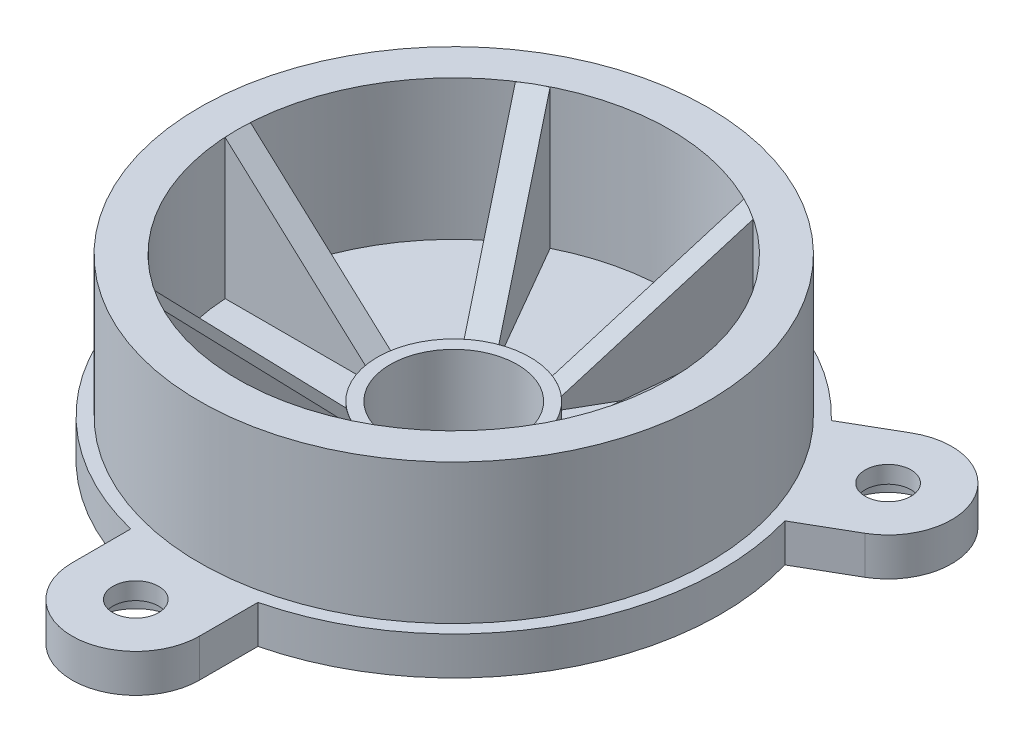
from build123d import *

# Parameters (mm, degrees)
BOSS_EXTRUDE1_DEPTH             = 3
CBORE_FOR_M3_SBHCS1_D           = 3.6
CBORE_FOR_M3_SBHCS1_CBORE_D     = 6.7
CBORE_FOR_M3_SBHCS1_CBORE_DEPTH = 1.65
CIRPATTERN1_COUNT               = 3
RIB1_REACH                      = 45.2
SKETCH5_WALL_W                  = 103.26644724
SKETCH5_WALL_H                  = 2
CIRPATTERN2_COUNT               = 6


with BuildPart() as part:
    # Sketch1 → Revolve1 (revolve)
    with BuildSketch(Plane(origin=(0, 0, 0), x_dir=(0, 0, -1), z_dir=(1, 0, 0))):
        Polygon((6, 6), (5, 6), (5, 0), (10, 0), (10, 2), (21, 2), (21, 5), (20, 5), (20, 16), (17, 16), (17, 5), (6, 5), align=None)
    revolve(axis=Axis((0, 0, 0), (0, 1, 0)))

    # Sketch2 → Boss-Extrude1 (add)
    with BuildSketch(Plane(origin=(0, 5, 0), x_dir=(1, 0, 0), z_dir=(0, 1, 0))):
        with BuildLine():
            Line((-5, -19.364916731), (-5, -25))
            ThreePointArc((-5, -25), (0, -30), (5, -25))
            Line((5, -25), (5, -19.364916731))
            ThreePointArc((5, -19.364916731), (0, -20), (-5, -19.364916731))
        make_face()
    boss_extrude1 = extrude(amount=-BOSS_EXTRUDE1_DEPTH)

    # CBORE for M3 SBHCS1 (through all)
    with Locations(Plane(origin=(0, 2, 0), x_dir=(-1, 0, 0), z_dir=(0, -1, 0))):
        with Locations((0, -25)):
            cbore_for_m3_sbhcs1 = CounterBoreHole(CBORE_FOR_M3_SBHCS1_D / 2, CBORE_FOR_M3_SBHCS1_CBORE_D / 2, CBORE_FOR_M3_SBHCS1_CBORE_DEPTH)

    # CirPattern1: Boss-Extrude1, CBORE for M3 SBHCS1 ×3 about axis
    cirpattern1_axis = Axis((0, 0, 0), (0, 1, 0))
    add([boss_extrude1.rotate(cirpattern1_axis, i * 360 / CIRPATTERN1_COUNT) for i in range(1, CIRPATTERN1_COUNT)])
    add([cbore_for_m3_sbhcs1.rotate(cirpattern1_axis, i * 360 / CIRPATTERN1_COUNT) for i in range(1, CIRPATTERN1_COUNT)], mode=Mode.SUBTRACT)

    # Sketch5 wall → Rib1 (add, up to next)
    with BuildSketch(Plane(origin=(-11.5, 11, 0), x_dir=(-0.739940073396, 0.672672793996, 0), z_dir=(-0.672672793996, -0.739940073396, 0)), mode=Mode.PRIVATE) as rib1_sk1:
        Rectangle(SKETCH5_WALL_W, SKETCH5_WALL_H)
    rib1_tool1 = extrude(rib1_sk1.sketch, amount=RIB1_REACH, mode=Mode.PRIVATE) - part.part
    rib1 = rib1_tool1.solids().sort_by_distance((-11.5, 11, 0))[0]
    add(rib1)

    # CirPattern2: Rib1 ×6 about axis
    cirpattern2_axis = Axis((0, 0, 0), (0, 1, 0))
    for i in range(1, CIRPATTERN2_COUNT):
        add(rib1.rotate(cirpattern2_axis, i * 360 / CIRPATTERN2_COUNT))


solid = part.part
